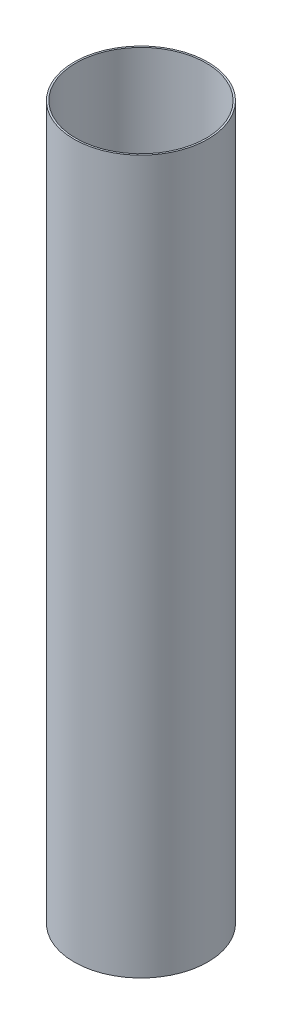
from build123d import *

# Parameters (mm, degrees)
SKETCH2_R           = 69.85
SKETCH2_R_2         = 68.072
BOSS_EXTRUDE1_DEPTH = 744.22


with BuildPart() as part:
    # Sketch2 → Boss-Extrude1 (new body)
    with BuildSketch(Plane(origin=(0, 0, 0), x_dir=(1, 0, 0), z_dir=(0, 1, 0))):
        with Locations(Location((0, 0, 0), (0, 0, 270))):
            Circle(SKETCH2_R)
        with Locations(Location((0, 0, 0), (0, 0, 270))):
            Circle(SKETCH2_R_2, mode=Mode.SUBTRACT)
    extrude(amount=BOSS_EXTRUDE1_DEPTH)


solid = part.part
